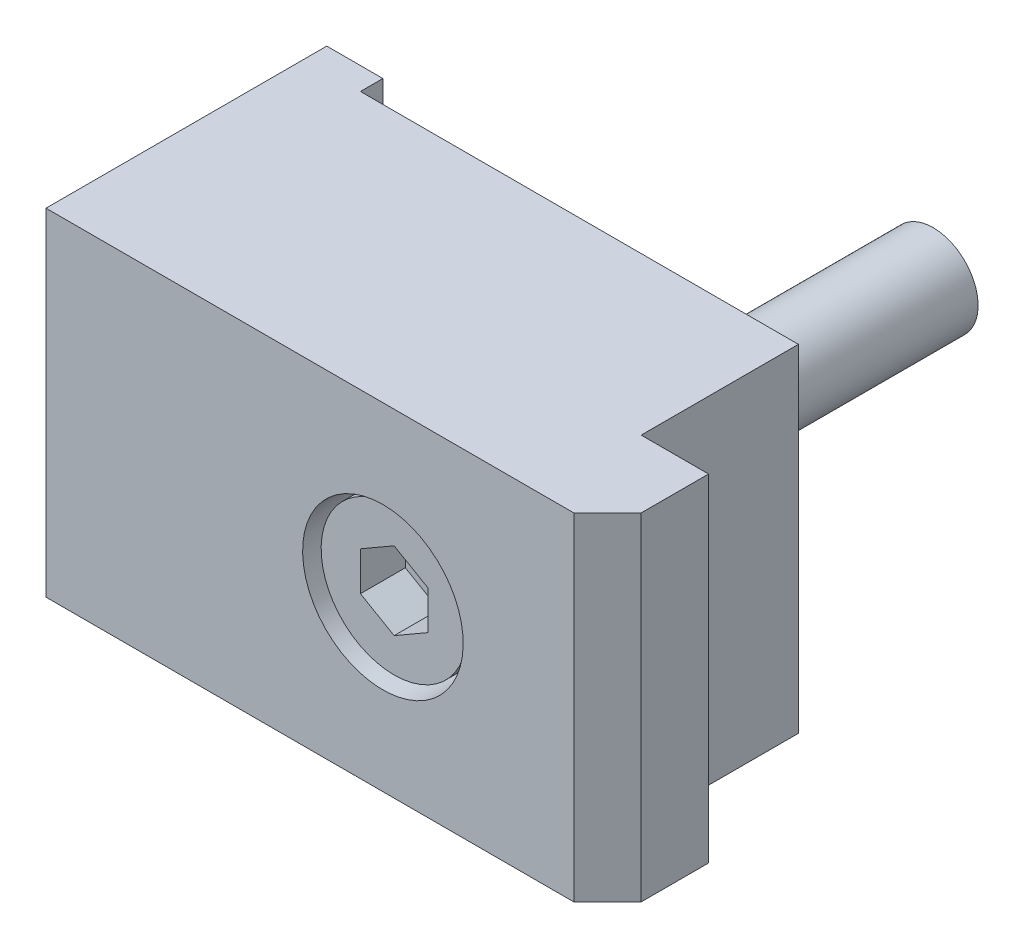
ISO-10303-21;
HEADER;
FILE_DESCRIPTION(('STEP AP214'),'2;1');
FILE_NAME('part.step','',(''),(''),'','','');
FILE_SCHEMA(('AUTOMOTIVE_DESIGN { 1 0 10303 214 1 1 1 1 }'));
ENDSEC;
DATA;
#1=APPLICATION_CONTEXT('core data for automotive mechanical design processes');
#2=APPLICATION_PROTOCOL_DEFINITION('international standard','automotive_design',2000,#1);
#3=PRODUCT_CONTEXT('',#1,'mechanical');
#4=PRODUCT('Part','Part','',(#3));
#5=PRODUCT_RELATED_PRODUCT_CATEGORY('part','',(#4));
#6=PRODUCT_DEFINITION_FORMATION('','',#4);
#7=PRODUCT_DEFINITION_CONTEXT('part definition',#1,'design');
#8=PRODUCT_DEFINITION('design','',#6,#7);
#9=PRODUCT_DEFINITION_SHAPE('','',#8);
#10=(LENGTH_UNIT() NAMED_UNIT(*) SI_UNIT(.MILLI.,.METRE.));
#11=(NAMED_UNIT(*) PLANE_ANGLE_UNIT() SI_UNIT($,.RADIAN.));
#12=(NAMED_UNIT(*) SI_UNIT($,.STERADIAN.) SOLID_ANGLE_UNIT());
#13=UNCERTAINTY_MEASURE_WITH_UNIT(LENGTH_MEASURE(1.E-05),#10,'distance_accuracy_value','');
#14=(GEOMETRIC_REPRESENTATION_CONTEXT(3) GLOBAL_UNCERTAINTY_ASSIGNED_CONTEXT((#13)) GLOBAL_UNIT_ASSIGNED_CONTEXT((#10,
#11,#12)) REPRESENTATION_CONTEXT('',''));
#15=CARTESIAN_POINT('',(0.,0.,0.));
#16=DIRECTION('',(0.,0.,1.));
#17=DIRECTION('',(1.,0.,0.));
#18=AXIS2_PLACEMENT_3D('',#15,#16,#17);
#19=CARTESIAN_POINT('',(-3.,-1.73205080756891,20.));
#20=DIRECTION('',(0.,0.,-1.));
#21=DIRECTION('',(0.,1.,0.));
#22=AXIS2_PLACEMENT_3D('',#19,#20,#21);
#23=PLANE('',#22);
#24=DIRECTION('',(0.866025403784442,-0.5,0.));
#25=VECTOR('',#24,1.);
#26=CARTESIAN_POINT('',(-3.,-1.73205080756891,20.));
#27=LINE('',#26,#25);
#28=CARTESIAN_POINT('',(-3.,-1.73205080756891,20.));
#29=VERTEX_POINT('',#28);
#30=CARTESIAN_POINT('',(0.,-3.46410161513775,20.));
#31=VERTEX_POINT('',#30);
#32=EDGE_CURVE('E259',#29,#31,#27,.T.);
#33=ORIENTED_EDGE('',*,*,#32,.T.);
#34=DIRECTION('',(0.866025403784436,0.5,0.));
#35=VECTOR('',#34,1.);
#36=CARTESIAN_POINT('',(0.,-3.46410161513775,20.));
#37=LINE('',#36,#35);
#38=CARTESIAN_POINT('',(3.,-1.73205080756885,20.));
#39=VERTEX_POINT('',#38);
#40=EDGE_CURVE('E261',#31,#39,#37,.T.);
#41=ORIENTED_EDGE('',*,*,#40,.T.);
#42=DIRECTION('',(0.,1.,0.));
#43=VECTOR('',#42,1.);
#44=CARTESIAN_POINT('',(3.,-1.73205080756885,20.));
#45=LINE('',#44,#43);
#46=CARTESIAN_POINT('',(3.,1.73205080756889,20.));
#47=VERTEX_POINT('',#46);
#48=EDGE_CURVE('E264',#39,#47,#45,.T.);
#49=ORIENTED_EDGE('',*,*,#48,.T.);
#50=DIRECTION('',(-0.866025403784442,0.5,0.));
#51=VECTOR('',#50,1.);
#52=CARTESIAN_POINT('',(3.,1.73205080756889,20.));
#53=LINE('',#52,#51);
#54=CARTESIAN_POINT('',(0.,3.46410161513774,20.));
#55=VERTEX_POINT('',#54);
#56=EDGE_CURVE('E154',#47,#55,#53,.T.);
#57=ORIENTED_EDGE('',*,*,#56,.T.);
#58=DIRECTION('',(-0.866025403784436,-0.5,0.));
#59=VECTOR('',#58,1.);
#60=CARTESIAN_POINT('',(0.,3.46410161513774,20.));
#61=LINE('',#60,#59);
#62=CARTESIAN_POINT('',(-3.,1.73205080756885,20.));
#63=VERTEX_POINT('',#62);
#64=EDGE_CURVE('E137',#55,#63,#61,.T.);
#65=ORIENTED_EDGE('',*,*,#64,.T.);
#66=DIRECTION('',(0.,-1.,0.));
#67=VECTOR('',#66,1.);
#68=CARTESIAN_POINT('',(-3.,1.73205080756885,20.));
#69=LINE('',#68,#67);
#70=EDGE_CURVE('E151',#63,#29,#69,.T.);
#71=ORIENTED_EDGE('',*,*,#70,.T.);
#72=EDGE_LOOP('',(#33,#41,#49,#57,#65,#71));
#73=FACE_BOUND('',#72,.T.);
#74=ADVANCED_FACE('F14',(#73),#23,.F.);
#75=CARTESIAN_POINT('',(0.,-3.46410161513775,20.));
#76=DIRECTION('',(0.5,-0.866025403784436,0.));
#77=DIRECTION('',(0.866025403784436,0.5,0.));
#78=AXIS2_PLACEMENT_3D('',#75,#76,#77);
#79=PLANE('',#78);
#80=DIRECTION('',(0.866025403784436,0.5,0.));
#81=VECTOR('',#80,1.);
#82=CARTESIAN_POINT('',(0.,-3.46410161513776,24.));
#83=LINE('',#82,#81);
#84=CARTESIAN_POINT('',(0.,-3.46410161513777,24.));
#85=VERTEX_POINT('',#84);
#86=CARTESIAN_POINT('',(3.,-1.73205080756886,24.));
#87=VERTEX_POINT('',#86);
#88=EDGE_CURVE('E246',#85,#87,#83,.T.);
#89=ORIENTED_EDGE('',*,*,#88,.T.);
#90=DIRECTION('',(0.,0.,1.));
#91=VECTOR('',#90,1.);
#92=CARTESIAN_POINT('',(3.,-1.73205080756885,20.));
#93=LINE('',#92,#91);
#94=EDGE_CURVE('E108',#39,#87,#93,.T.);
#95=ORIENTED_EDGE('',*,*,#94,.F.);
#96=ORIENTED_EDGE('',*,*,#40,.F.);
#97=DIRECTION('',(0.,0.,1.));
#98=VECTOR('',#97,1.);
#99=CARTESIAN_POINT('',(0.,-3.46410161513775,20.));
#100=LINE('',#99,#98);
#101=EDGE_CURVE('E158',#31,#85,#100,.T.);
#102=ORIENTED_EDGE('',*,*,#101,.T.);
#103=EDGE_LOOP('',(#89,#95,#96,#102));
#104=FACE_BOUND('',#103,.T.);
#105=ADVANCED_FACE('F276',(#104),#79,.F.);
#106=CARTESIAN_POINT('',(3.,-1.73205080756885,20.));
#107=DIRECTION('',(1.,0.,0.));
#108=DIRECTION('',(0.,1.,0.));
#109=AXIS2_PLACEMENT_3D('',#106,#107,#108);
#110=PLANE('',#109);
#111=DIRECTION('',(0.,1.,0.));
#112=VECTOR('',#111,1.);
#113=CARTESIAN_POINT('',(3.,-1.73205080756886,24.));
#114=LINE('',#113,#112);
#115=CARTESIAN_POINT('',(3.,1.73205080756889,24.));
#116=VERTEX_POINT('',#115);
#117=EDGE_CURVE('E248',#87,#116,#114,.T.);
#118=ORIENTED_EDGE('',*,*,#117,.T.);
#119=DIRECTION('',(0.,0.,1.));
#120=VECTOR('',#119,1.);
#121=CARTESIAN_POINT('',(3.,1.73205080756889,20.));
#122=LINE('',#121,#120);
#123=EDGE_CURVE('E166',#47,#116,#122,.T.);
#124=ORIENTED_EDGE('',*,*,#123,.F.);
#125=ORIENTED_EDGE('',*,*,#48,.F.);
#126=ORIENTED_EDGE('',*,*,#94,.T.);
#127=EDGE_LOOP('',(#118,#124,#125,#126));
#128=FACE_BOUND('',#127,.T.);
#129=ADVANCED_FACE('F266',(#128),#110,.F.);
#130=CARTESIAN_POINT('',(3.,1.73205080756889,20.));
#131=DIRECTION('',(0.5,0.866025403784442,0.));
#132=DIRECTION('',(-0.866025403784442,0.5,0.));
#133=AXIS2_PLACEMENT_3D('',#130,#131,#132);
#134=PLANE('',#133);
#135=DIRECTION('',(-0.866025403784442,0.5,0.));
#136=VECTOR('',#135,1.);
#137=CARTESIAN_POINT('',(3.,1.73205080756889,24.));
#138=LINE('',#137,#136);
#139=CARTESIAN_POINT('',(0.,3.46410161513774,24.));
#140=VERTEX_POINT('',#139);
#141=EDGE_CURVE('E253',#116,#140,#138,.T.);
#142=ORIENTED_EDGE('',*,*,#141,.T.);
#143=DIRECTION('',(0.,0.,1.));
#144=VECTOR('',#143,1.);
#145=CARTESIAN_POINT('',(0.,3.46410161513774,20.));
#146=LINE('',#145,#144);
#147=EDGE_CURVE('E146',#55,#140,#146,.T.);
#148=ORIENTED_EDGE('',*,*,#147,.F.);
#149=ORIENTED_EDGE('',*,*,#56,.F.);
#150=ORIENTED_EDGE('',*,*,#123,.T.);
#151=EDGE_LOOP('',(#142,#148,#149,#150));
#152=FACE_BOUND('',#151,.T.);
#153=ADVANCED_FACE('F270',(#152),#134,.F.);
#154=CARTESIAN_POINT('',(0.,3.46410161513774,20.));
#155=DIRECTION('',(-0.5,0.866025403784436,0.));
#156=DIRECTION('',(-0.866025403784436,-0.5,0.));
#157=AXIS2_PLACEMENT_3D('',#154,#155,#156);
#158=PLANE('',#157);
#159=DIRECTION('',(-0.866025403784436,-0.5,0.));
#160=VECTOR('',#159,1.);
#161=CARTESIAN_POINT('',(0.,3.46410161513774,24.));
#162=LINE('',#161,#160);
#163=CARTESIAN_POINT('',(-3.,1.73205080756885,24.));
#164=VERTEX_POINT('',#163);
#165=EDGE_CURVE('E140',#140,#164,#162,.T.);
#166=ORIENTED_EDGE('',*,*,#165,.T.);
#167=DIRECTION('',(0.,0.,1.));
#168=VECTOR('',#167,1.);
#169=CARTESIAN_POINT('',(-3.,1.73205080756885,20.));
#170=LINE('',#169,#168);
#171=EDGE_CURVE('E134',#63,#164,#170,.T.);
#172=ORIENTED_EDGE('',*,*,#171,.F.);
#173=ORIENTED_EDGE('',*,*,#64,.F.);
#174=ORIENTED_EDGE('',*,*,#147,.T.);
#175=EDGE_LOOP('',(#166,#172,#173,#174));
#176=FACE_BOUND('',#175,.T.);
#177=ADVANCED_FACE('F136',(#176),#158,.F.);
#178=CARTESIAN_POINT('',(-3.,1.73205080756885,20.));
#179=DIRECTION('',(-1.,0.,0.));
#180=DIRECTION('',(0.,-1.,0.));
#181=AXIS2_PLACEMENT_3D('',#178,#179,#180);
#182=PLANE('',#181);
#183=DIRECTION('',(0.,-1.,0.));
#184=VECTOR('',#183,1.);
#185=CARTESIAN_POINT('',(-3.,1.73205080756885,24.));
#186=LINE('',#185,#184);
#187=CARTESIAN_POINT('',(-3.,-1.73205080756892,24.));
#188=VERTEX_POINT('',#187);
#189=EDGE_CURVE('E257',#164,#188,#186,.T.);
#190=ORIENTED_EDGE('',*,*,#189,.T.);
#191=DIRECTION('',(0.,0.,1.));
#192=VECTOR('',#191,1.);
#193=CARTESIAN_POINT('',(-3.,-1.73205080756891,20.));
#194=LINE('',#193,#192);
#195=EDGE_CURVE('E145',#29,#188,#194,.T.);
#196=ORIENTED_EDGE('',*,*,#195,.F.);
#197=ORIENTED_EDGE('',*,*,#70,.F.);
#198=ORIENTED_EDGE('',*,*,#171,.T.);
#199=EDGE_LOOP('',(#190,#196,#197,#198));
#200=FACE_BOUND('',#199,.T.);
#201=ADVANCED_FACE('F156',(#200),#182,.F.);
#202=CARTESIAN_POINT('',(-3.,-1.73205080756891,20.));
#203=DIRECTION('',(-0.5,-0.866025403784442,0.));
#204=DIRECTION('',(0.866025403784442,-0.5,0.));
#205=AXIS2_PLACEMENT_3D('',#202,#203,#204);
#206=PLANE('',#205);
#207=DIRECTION('',(0.866025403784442,-0.5,0.));
#208=VECTOR('',#207,1.);
#209=CARTESIAN_POINT('',(-3.,-1.73205080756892,24.));
#210=LINE('',#209,#208);
#211=EDGE_CURVE('E33',#188,#85,#210,.T.);
#212=ORIENTED_EDGE('',*,*,#211,.T.);
#213=ORIENTED_EDGE('',*,*,#101,.F.);
#214=ORIENTED_EDGE('',*,*,#32,.F.);
#215=ORIENTED_EDGE('',*,*,#195,.T.);
#216=EDGE_LOOP('',(#212,#213,#214,#215));
#217=FACE_BOUND('',#216,.T.);
#218=ADVANCED_FACE('F277',(#217),#206,.F.);
#219=CARTESIAN_POINT('',(0.,0.,24.));
#220=DIRECTION('',(0.,0.,1.));
#221=DIRECTION('',(0.,-1.,0.));
#222=AXIS2_PLACEMENT_3D('',#219,#220,#221);
#223=PLANE('',#222);
#224=ORIENTED_EDGE('',*,*,#211,.F.);
#225=ORIENTED_EDGE('',*,*,#189,.F.);
#226=ORIENTED_EDGE('',*,*,#165,.F.);
#227=ORIENTED_EDGE('',*,*,#141,.F.);
#228=ORIENTED_EDGE('',*,*,#117,.F.);
#229=ORIENTED_EDGE('',*,*,#88,.F.);
#230=EDGE_LOOP('',(#224,#225,#226,#227,#228,#229));
#231=FACE_BOUND('',#230,.T.);
#232=CARTESIAN_POINT('',(0.,0.,24.));
#233=DIRECTION('',(0.,0.,1.));
#234=DIRECTION('',(0.,-1.,0.));
#235=AXIS2_PLACEMENT_3D('',#232,#233,#234);
#236=CIRCLE('',#235,6.5);
#237=CARTESIAN_POINT('',(0.,-6.5,24.));
#238=VERTEX_POINT('',#237);
#239=EDGE_CURVE('E171',#238,#238,#236,.T.);
#240=ORIENTED_EDGE('',*,*,#239,.T.);
#241=EDGE_LOOP('',(#240));
#242=FACE_BOUND('',#241,.T.);
#243=ADVANCED_FACE('F272',(#231,#242),#223,.T.);
#244=CARTESIAN_POINT('',(0.,0.,24.));
#245=DIRECTION('',(0.,0.,-1.));
#246=DIRECTION('',(0.,1.,0.));
#247=AXIS2_PLACEMENT_3D('',#244,#245,#246);
#248=CYLINDRICAL_SURFACE('',#247,6.5);
#249=ORIENTED_EDGE('',*,*,#239,.F.);
#250=EDGE_LOOP('',(#249));
#251=FACE_BOUND('',#250,.T.);
#252=CARTESIAN_POINT('',(0.,0.,16.));
#253=DIRECTION('',(0.,0.,1.));
#254=DIRECTION('',(0.,-1.,0.));
#255=AXIS2_PLACEMENT_3D('',#252,#253,#254);
#256=CIRCLE('',#255,6.5);
#257=CARTESIAN_POINT('',(0.,-6.5,16.));
#258=VERTEX_POINT('',#257);
#259=EDGE_CURVE('E163',#258,#258,#256,.T.);
#260=ORIENTED_EDGE('',*,*,#259,.T.);
#261=EDGE_LOOP('',(#260));
#262=FACE_BOUND('',#261,.T.);
#263=ADVANCED_FACE('F286',(#251,#262),#248,.T.);
#264=CARTESIAN_POINT('',(0.,0.,16.));
#265=DIRECTION('',(0.,0.,1.));
#266=DIRECTION('',(0.,-1.,0.));
#267=AXIS2_PLACEMENT_3D('',#264,#265,#266);
#268=PLANE('',#267);
#269=CARTESIAN_POINT('',(0.,0.,16.));
#270=DIRECTION('',(0.,0.,1.));
#271=DIRECTION('',(0.,-1.,0.));
#272=AXIS2_PLACEMENT_3D('',#269,#270,#271);
#273=CIRCLE('',#272,4.);
#274=CARTESIAN_POINT('',(0.,-4.,16.));
#275=VERTEX_POINT('',#274);
#276=EDGE_CURVE('E24',#275,#275,#273,.T.);
#277=ORIENTED_EDGE('',*,*,#276,.T.);
#278=EDGE_LOOP('',(#277));
#279=FACE_BOUND('',#278,.T.);
#280=CARTESIAN_POINT('',(0.,0.,16.));
#281=DIRECTION('',(0.,0.,1.));
#282=DIRECTION('',(0.,-1.,0.));
#283=AXIS2_PLACEMENT_3D('',#280,#281,#282);
#284=CIRCLE('',#283,4.5);
#285=CARTESIAN_POINT('',(0.,-4.49999999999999,16.));
#286=VERTEX_POINT('',#285);
#287=EDGE_CURVE('E9',#286,#286,#284,.T.);
#288=ORIENTED_EDGE('',*,*,#287,.F.);
#289=EDGE_LOOP('',(#288));
#290=FACE_BOUND('',#289,.T.);
#291=ADVANCED_FACE('F360',(#279,#290),#268,.F.);
#292=CARTESIAN_POINT('',(0.,0.,16.));
#293=DIRECTION('',(0.,0.,-1.));
#294=DIRECTION('',(0.,1.,0.));
#295=AXIS2_PLACEMENT_3D('',#292,#293,#294);
#296=CYLINDRICAL_SURFACE('',#295,4.);
#297=ORIENTED_EDGE('',*,*,#276,.F.);
#298=EDGE_LOOP('',(#297));
#299=FACE_BOUND('',#298,.T.);
#300=CARTESIAN_POINT('',(0.,0.,-24.));
#301=DIRECTION('',(0.,0.,-1.));
#302=DIRECTION('',(-1.,0.,0.));
#303=AXIS2_PLACEMENT_3D('',#300,#301,#302);
#304=CIRCLE('',#303,4.);
#305=CARTESIAN_POINT('',(-4.,0.,-24.));
#306=VERTEX_POINT('',#305);
#307=EDGE_CURVE('E180',#306,#306,#304,.T.);
#308=ORIENTED_EDGE('',*,*,#307,.F.);
#309=EDGE_LOOP('',(#308));
#310=FACE_BOUND('',#309,.T.);
#311=ADVANCED_FACE('F368',(#299,#310),#296,.T.);
#312=CARTESIAN_POINT('',(14.,15.,16.));
#313=DIRECTION('',(0.,0.,1.));
#314=DIRECTION('',(1.,0.,0.));
#315=AXIS2_PLACEMENT_3D('',#312,#313,#314);
#316=PLANE('',#315);
#317=DIRECTION('',(-1.,0.,0.));
#318=VECTOR('',#317,1.);
#319=CARTESIAN_POINT('',(14.,-15.,16.));
#320=LINE('',#319,#318);
#321=CARTESIAN_POINT('',(20.,-15.,16.));
#322=VERTEX_POINT('',#321);
#323=CARTESIAN_POINT('',(14.,-15.,16.));
#324=VERTEX_POINT('',#323);
#325=EDGE_CURVE('E198',#322,#324,#320,.T.);
#326=ORIENTED_EDGE('',*,*,#325,.T.);
#327=DIRECTION('',(0.,-1.,0.));
#328=VECTOR('',#327,1.);
#329=CARTESIAN_POINT('',(14.,15.,16.));
#330=LINE('',#329,#328);
#331=CARTESIAN_POINT('',(14.,15.,16.));
#332=VERTEX_POINT('',#331);
#333=EDGE_CURVE('E217',#332,#324,#330,.T.);
#334=ORIENTED_EDGE('',*,*,#333,.F.);
#335=DIRECTION('',(-1.,0.,0.));
#336=VECTOR('',#335,1.);
#337=CARTESIAN_POINT('',(14.,15.,16.));
#338=LINE('',#337,#336);
#339=CARTESIAN_POINT('',(20.,15.,16.));
#340=VERTEX_POINT('',#339);
#341=EDGE_CURVE('E215',#340,#332,#338,.T.);
#342=ORIENTED_EDGE('',*,*,#341,.F.);
#343=DIRECTION('',(0.,-1.,0.));
#344=VECTOR('',#343,1.);
#345=CARTESIAN_POINT('',(20.,15.,16.));
#346=LINE('',#345,#344);
#347=EDGE_CURVE('E220',#340,#322,#346,.T.);
#348=ORIENTED_EDGE('',*,*,#347,.T.);
#349=EDGE_LOOP('',(#326,#334,#342,#348));
#350=FACE_BOUND('',#349,.T.);
#351=ADVANCED_FACE('F377',(#350),#316,.F.);
#352=CARTESIAN_POINT('',(-25.,15.,0.));
#353=DIRECTION('',(0.,0.,1.));
#354=DIRECTION('',(0.,1.,0.));
#355=AXIS2_PLACEMENT_3D('',#352,#353,#354);
#356=PLANE('',#355);
#357=DIRECTION('',(-1.,0.,0.));
#358=VECTOR('',#357,1.);
#359=CARTESIAN_POINT('',(-25.,-15.,0.));
#360=LINE('',#359,#358);
#361=CARTESIAN_POINT('',(-25.,-15.,0.));
#362=VERTEX_POINT('',#361);
#363=CARTESIAN_POINT('',(-30.,-15.,0.));
#364=VERTEX_POINT('',#363);
#365=EDGE_CURVE('E190',#362,#364,#360,.T.);
#366=ORIENTED_EDGE('',*,*,#365,.T.);
#367=DIRECTION('',(0.,-1.,0.));
#368=VECTOR('',#367,1.);
#369=CARTESIAN_POINT('',(-30.,15.,0.));
#370=LINE('',#369,#368);
#371=CARTESIAN_POINT('',(-30.,15.,0.));
#372=VERTEX_POINT('',#371);
#373=EDGE_CURVE('E226',#372,#364,#370,.T.);
#374=ORIENTED_EDGE('',*,*,#373,.F.);
#375=DIRECTION('',(-1.,0.,0.));
#376=VECTOR('',#375,1.);
#377=CARTESIAN_POINT('',(-25.,15.,0.));
#378=LINE('',#377,#376);
#379=CARTESIAN_POINT('',(-25.,15.,0.));
#380=VERTEX_POINT('',#379);
#381=EDGE_CURVE('E207',#380,#372,#378,.T.);
#382=ORIENTED_EDGE('',*,*,#381,.F.);
#383=DIRECTION('',(0.,-1.,0.));
#384=VECTOR('',#383,1.);
#385=CARTESIAN_POINT('',(-25.,15.,0.));
#386=LINE('',#385,#384);
#387=EDGE_CURVE('E229',#380,#362,#386,.T.);
#388=ORIENTED_EDGE('',*,*,#387,.T.);
#389=EDGE_LOOP('',(#366,#374,#382,#388));
#390=FACE_BOUND('',#389,.T.);
#391=ADVANCED_FACE('F386',(#390),#356,.F.);
#392=CARTESIAN_POINT('',(20.,15.,16.));
#393=DIRECTION('',(-1.,0.,0.));
#394=DIRECTION('',(0.,-1.,0.));
#395=AXIS2_PLACEMENT_3D('',#392,#393,#394);
#396=PLANE('',#395);
#397=DIRECTION('',(0.,0.,-1.));
#398=VECTOR('',#397,1.);
#399=CARTESIAN_POINT('',(20.,15.,16.));
#400=LINE('',#399,#398);
#401=CARTESIAN_POINT('',(20.,15.,22.));
#402=VERTEX_POINT('',#401);
#403=EDGE_CURVE('E213',#402,#340,#400,.T.);
#404=ORIENTED_EDGE('',*,*,#403,.F.);
#405=DIRECTION('',(0.,-1.,0.));
#406=VECTOR('',#405,1.);
#407=CARTESIAN_POINT('',(20.,15.,22.));
#408=LINE('',#407,#406);
#409=CARTESIAN_POINT('',(20.,-15.,22.));
#410=VERTEX_POINT('',#409);
#411=EDGE_CURVE('E238',#402,#410,#408,.T.);
#412=ORIENTED_EDGE('',*,*,#411,.T.);
#413=DIRECTION('',(0.,0.,-1.));
#414=VECTOR('',#413,1.);
#415=CARTESIAN_POINT('',(20.,-15.,16.));
#416=LINE('',#415,#414);
#417=EDGE_CURVE('E196',#410,#322,#416,.T.);
#418=ORIENTED_EDGE('',*,*,#417,.T.);
#419=ORIENTED_EDGE('',*,*,#347,.F.);
#420=EDGE_LOOP('',(#404,#412,#418,#419));
#421=FACE_BOUND('',#420,.T.);
#422=ADVANCED_FACE('F390',(#421),#396,.F.);
#423=CARTESIAN_POINT('',(-30.,15.,25.));
#424=DIRECTION('',(1.,0.,0.));
#425=DIRECTION('',(0.,0.,-1.));
#426=AXIS2_PLACEMENT_3D('',#423,#424,#425);
#427=PLANE('',#426);
#428=DIRECTION('',(0.,0.,1.));
#429=VECTOR('',#428,1.);
#430=CARTESIAN_POINT('',(-30.,-15.,25.));
#431=LINE('',#430,#429);
#432=CARTESIAN_POINT('',(-30.,-15.,25.));
#433=VERTEX_POINT('',#432);
#434=EDGE_CURVE('E192',#364,#433,#431,.T.);
#435=ORIENTED_EDGE('',*,*,#434,.T.);
#436=DIRECTION('',(0.,-1.,0.));
#437=VECTOR('',#436,1.);
#438=CARTESIAN_POINT('',(-30.,15.,25.));
#439=LINE('',#438,#437);
#440=CARTESIAN_POINT('',(-30.,15.,25.));
#441=VERTEX_POINT('',#440);
#442=EDGE_CURVE('E223',#441,#433,#439,.T.);
#443=ORIENTED_EDGE('',*,*,#442,.F.);
#444=DIRECTION('',(0.,0.,1.));
#445=VECTOR('',#444,1.);
#446=CARTESIAN_POINT('',(-30.,15.,25.));
#447=LINE('',#446,#445);
#448=EDGE_CURVE('E209',#372,#441,#447,.T.);
#449=ORIENTED_EDGE('',*,*,#448,.F.);
#450=ORIENTED_EDGE('',*,*,#373,.T.);
#451=EDGE_LOOP('',(#435,#443,#449,#450));
#452=FACE_BOUND('',#451,.T.);
#453=ADVANCED_FACE('F399',(#452),#427,.F.);
#454=CARTESIAN_POINT('',(20.,15.,22.));
#455=DIRECTION('',(-0.707106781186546,0.,-0.707106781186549));
#456=DIRECTION('',(-0.707106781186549,0.,0.707106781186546));
#457=AXIS2_PLACEMENT_3D('',#454,#455,#456);
#458=PLANE('',#457);
#459=DIRECTION('',(-0.707106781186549,0.,0.707106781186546));
#460=VECTOR('',#459,1.);
#461=CARTESIAN_POINT('',(20.,15.,22.));
#462=LINE('',#461,#460);
#463=CARTESIAN_POINT('',(17.,15.,25.));
#464=VERTEX_POINT('',#463);
#465=EDGE_CURVE('E242',#464,#402,#462,.F.);
#466=ORIENTED_EDGE('',*,*,#465,.F.);
#467=DIRECTION('',(0.,1.,0.));
#468=VECTOR('',#467,1.);
#469=CARTESIAN_POINT('',(17.,15.,25.));
#470=LINE('',#469,#468);
#471=CARTESIAN_POINT('',(17.,-15.,25.));
#472=VERTEX_POINT('',#471);
#473=EDGE_CURVE('E99',#472,#464,#470,.T.);
#474=ORIENTED_EDGE('',*,*,#473,.F.);
#475=DIRECTION('',(0.707106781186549,0.,-0.707106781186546));
#476=VECTOR('',#475,1.);
#477=CARTESIAN_POINT('',(15.5,-15.,26.5));
#478=LINE('',#477,#476);
#479=EDGE_CURVE('E92',#410,#472,#478,.F.);
#480=ORIENTED_EDGE('',*,*,#479,.F.);
#481=ORIENTED_EDGE('',*,*,#411,.F.);
#482=EDGE_LOOP('',(#466,#474,#480,#481));
#483=FACE_BOUND('',#482,.T.);
#484=ADVANCED_FACE('F416',(#483),#458,.F.);
#485=CARTESIAN_POINT('',(14.,15.,2.));
#486=DIRECTION('',(-1.,0.,0.));
#487=DIRECTION('',(0.,-1.,0.));
#488=AXIS2_PLACEMENT_3D('',#485,#486,#487);
#489=PLANE('',#488);
#490=DIRECTION('',(0.,0.,-1.));
#491=VECTOR('',#490,1.);
#492=CARTESIAN_POINT('',(14.,-15.,2.));
#493=LINE('',#492,#491);
#494=CARTESIAN_POINT('',(14.,-15.,2.));
#495=VERTEX_POINT('',#494);
#496=EDGE_CURVE('E183',#324,#495,#493,.T.);
#497=ORIENTED_EDGE('',*,*,#496,.T.);
#498=DIRECTION('',(0.,-1.,0.));
#499=VECTOR('',#498,1.);
#500=CARTESIAN_POINT('',(14.,15.,2.));
#501=LINE('',#500,#499);
#502=CARTESIAN_POINT('',(14.,15.,2.));
#503=VERTEX_POINT('',#502);
#504=EDGE_CURVE('E235',#503,#495,#501,.T.);
#505=ORIENTED_EDGE('',*,*,#504,.F.);
#506=DIRECTION('',(0.,0.,-1.));
#507=VECTOR('',#506,1.);
#508=CARTESIAN_POINT('',(14.,15.,2.));
#509=LINE('',#508,#507);
#510=EDGE_CURVE('E200',#332,#503,#509,.T.);
#511=ORIENTED_EDGE('',*,*,#510,.F.);
#512=ORIENTED_EDGE('',*,*,#333,.T.);
#513=EDGE_LOOP('',(#497,#505,#511,#512));
#514=FACE_BOUND('',#513,.T.);
#515=ADVANCED_FACE('F16',(#514),#489,.F.);
#516=CARTESIAN_POINT('',(14.,15.,25.));
#517=DIRECTION('',(0.,-1.,0.));
#518=DIRECTION('',(1.,0.,0.));
#519=AXIS2_PLACEMENT_3D('',#516,#517,#518);
#520=PLANE('',#519);
#521=DIRECTION('',(1.,0.,0.));
#522=VECTOR('',#521,1.);
#523=CARTESIAN_POINT('',(20.,15.,25.));
#524=LINE('',#523,#522);
#525=EDGE_CURVE('E211',#441,#464,#524,.T.);
#526=ORIENTED_EDGE('',*,*,#525,.T.);
#527=ORIENTED_EDGE('',*,*,#465,.T.);
#528=ORIENTED_EDGE('',*,*,#403,.T.);
#529=ORIENTED_EDGE('',*,*,#341,.T.);
#530=ORIENTED_EDGE('',*,*,#510,.T.);
#531=DIRECTION('',(-1.,0.,0.));
#532=VECTOR('',#531,1.);
#533=CARTESIAN_POINT('',(14.,15.,2.));
#534=LINE('',#533,#532);
#535=CARTESIAN_POINT('',(-25.,15.,2.));
#536=VERTEX_POINT('',#535);
#537=EDGE_CURVE('E203',#503,#536,#534,.T.);
#538=ORIENTED_EDGE('',*,*,#537,.T.);
#539=DIRECTION('',(0.,0.,-1.));
#540=VECTOR('',#539,1.);
#541=CARTESIAN_POINT('',(-25.,15.,2.));
#542=LINE('',#541,#540);
#543=EDGE_CURVE('E205',#536,#380,#542,.T.);
#544=ORIENTED_EDGE('',*,*,#543,.T.);
#545=ORIENTED_EDGE('',*,*,#381,.T.);
#546=ORIENTED_EDGE('',*,*,#448,.T.);
#547=EDGE_LOOP('',(#526,#527,#528,#529,#530,#538,#544,#545,#546));
#548=FACE_BOUND('',#547,.T.);
#549=ADVANCED_FACE('F389',(#548),#520,.F.);
#550=CARTESIAN_POINT('',(-25.,15.,2.));
#551=DIRECTION('',(-1.,0.,0.));
#552=DIRECTION('',(0.,-1.,0.));
#553=AXIS2_PLACEMENT_3D('',#550,#551,#552);
#554=PLANE('',#553);
#555=DIRECTION('',(0.,0.,-1.));
#556=VECTOR('',#555,1.);
#557=CARTESIAN_POINT('',(-25.,-15.,2.));
#558=LINE('',#557,#556);
#559=CARTESIAN_POINT('',(-25.,-15.,2.));
#560=VERTEX_POINT('',#559);
#561=EDGE_CURVE('E188',#560,#362,#558,.T.);
#562=ORIENTED_EDGE('',*,*,#561,.T.);
#563=ORIENTED_EDGE('',*,*,#387,.F.);
#564=ORIENTED_EDGE('',*,*,#543,.F.);
#565=DIRECTION('',(0.,-1.,0.));
#566=VECTOR('',#565,1.);
#567=CARTESIAN_POINT('',(-25.,15.,2.));
#568=LINE('',#567,#566);
#569=EDGE_CURVE('E232',#536,#560,#568,.T.);
#570=ORIENTED_EDGE('',*,*,#569,.T.);
#571=EDGE_LOOP('',(#562,#563,#564,#570));
#572=FACE_BOUND('',#571,.T.);
#573=ADVANCED_FACE('F400',(#572),#554,.F.);
#574=CARTESIAN_POINT('',(14.,-15.,25.));
#575=DIRECTION('',(0.,-1.,0.));
#576=DIRECTION('',(1.,0.,0.));
#577=AXIS2_PLACEMENT_3D('',#574,#575,#576);
#578=PLANE('',#577);
#579=ORIENTED_EDGE('',*,*,#417,.F.);
#580=ORIENTED_EDGE('',*,*,#479,.T.);
#581=DIRECTION('',(1.,0.,0.));
#582=VECTOR('',#581,1.);
#583=CARTESIAN_POINT('',(20.,-15.,25.));
#584=LINE('',#583,#582);
#585=EDGE_CURVE('E194',#433,#472,#584,.T.);
#586=ORIENTED_EDGE('',*,*,#585,.F.);
#587=ORIENTED_EDGE('',*,*,#434,.F.);
#588=ORIENTED_EDGE('',*,*,#365,.F.);
#589=ORIENTED_EDGE('',*,*,#561,.F.);
#590=DIRECTION('',(-1.,0.,0.));
#591=VECTOR('',#590,1.);
#592=CARTESIAN_POINT('',(14.,-15.,2.));
#593=LINE('',#592,#591);
#594=EDGE_CURVE('E186',#495,#560,#593,.T.);
#595=ORIENTED_EDGE('',*,*,#594,.F.);
#596=ORIENTED_EDGE('',*,*,#496,.F.);
#597=ORIENTED_EDGE('',*,*,#325,.F.);
#598=EDGE_LOOP('',(#579,#580,#586,#587,#588,#589,#595,#596,#597));
#599=FACE_BOUND('',#598,.T.);
#600=ADVANCED_FACE('F428',(#599),#578,.T.);
#601=CARTESIAN_POINT('',(14.,15.,2.));
#602=DIRECTION('',(0.,0.,1.));
#603=DIRECTION('',(0.,1.,0.));
#604=AXIS2_PLACEMENT_3D('',#601,#602,#603);
#605=PLANE('',#604);
#606=CARTESIAN_POINT('',(0.,0.,2.));
#607=DIRECTION('',(0.,0.,1.));
#608=DIRECTION('',(0.,1.,0.));
#609=AXIS2_PLACEMENT_3D('',#606,#607,#608);
#610=CIRCLE('',#609,4.5);
#611=CARTESIAN_POINT('',(0.,4.50000000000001,2.));
#612=VERTEX_POINT('',#611);
#613=EDGE_CURVE('E18',#612,#612,#610,.T.);
#614=ORIENTED_EDGE('',*,*,#613,.T.);
#615=EDGE_LOOP('',(#614));
#616=FACE_BOUND('',#615,.T.);
#617=ORIENTED_EDGE('',*,*,#594,.T.);
#618=ORIENTED_EDGE('',*,*,#569,.F.);
#619=ORIENTED_EDGE('',*,*,#537,.F.);
#620=ORIENTED_EDGE('',*,*,#504,.T.);
#621=EDGE_LOOP('',(#617,#618,#619,#620));
#622=FACE_BOUND('',#621,.T.);
#623=ADVANCED_FACE('F436',(#616,#622),#605,.F.);
#624=CARTESIAN_POINT('',(0.,0.,25.));
#625=DIRECTION('',(0.,0.,1.));
#626=DIRECTION('',(0.,1.,0.));
#627=AXIS2_PLACEMENT_3D('',#624,#625,#626);
#628=CYLINDRICAL_SURFACE('',#627,4.5);
#629=ORIENTED_EDGE('',*,*,#287,.T.);
#630=EDGE_LOOP('',(#629));
#631=FACE_BOUND('',#630,.T.);
#632=ORIENTED_EDGE('',*,*,#613,.F.);
#633=EDGE_LOOP('',(#632));
#634=FACE_BOUND('',#633,.T.);
#635=ADVANCED_FACE('F427',(#631,#634),#628,.F.);
#636=CARTESIAN_POINT('',(20.,15.,25.));
#637=DIRECTION('',(0.,0.,-1.));
#638=DIRECTION('',(0.,-1.,0.));
#639=AXIS2_PLACEMENT_3D('',#636,#637,#638);
#640=PLANE('',#639);
#641=CARTESIAN_POINT('',(0.,0.,25.));
#642=DIRECTION('',(0.,0.,1.));
#643=DIRECTION('',(0.,1.,0.));
#644=AXIS2_PLACEMENT_3D('',#641,#642,#643);
#645=CIRCLE('',#644,7.15);
#646=CARTESIAN_POINT('',(0.,7.15000000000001,25.));
#647=VERTEX_POINT('',#646);
#648=EDGE_CURVE('E179',#647,#647,#645,.T.);
#649=ORIENTED_EDGE('',*,*,#648,.F.);
#650=EDGE_LOOP('',(#649));
#651=FACE_BOUND('',#650,.T.);
#652=ORIENTED_EDGE('',*,*,#585,.T.);
#653=ORIENTED_EDGE('',*,*,#473,.T.);
#654=ORIENTED_EDGE('',*,*,#525,.F.);
#655=ORIENTED_EDGE('',*,*,#442,.T.);
#656=EDGE_LOOP('',(#652,#653,#654,#655));
#657=FACE_BOUND('',#656,.T.);
#658=ADVANCED_FACE('F409',(#651,#657),#640,.F.);
#659=CARTESIAN_POINT('',(0.,0.,25.));
#660=DIRECTION('',(0.,0.,1.));
#661=DIRECTION('',(0.,1.,0.));
#662=AXIS2_PLACEMENT_3D('',#659,#660,#661);
#663=CYLINDRICAL_SURFACE('',#662,7.15);
#664=CARTESIAN_POINT('',(0.,0.,16.));
#665=DIRECTION('',(0.,0.,1.));
#666=DIRECTION('',(0.,1.,0.));
#667=AXIS2_PLACEMENT_3D('',#664,#665,#666);
#668=CIRCLE('',#667,7.15);
#669=CARTESIAN_POINT('',(0.,7.15000000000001,16.));
#670=VERTEX_POINT('',#669);
#671=EDGE_CURVE('E176',#670,#670,#668,.T.);
#672=ORIENTED_EDGE('',*,*,#671,.F.);
#673=EDGE_LOOP('',(#672));
#674=FACE_BOUND('',#673,.T.);
#675=ORIENTED_EDGE('',*,*,#648,.T.);
#676=EDGE_LOOP('',(#675));
#677=FACE_BOUND('',#676,.T.);
#678=ADVANCED_FACE('F474',(#674,#677),#663,.F.);
#679=CARTESIAN_POINT('',(-4.5,0.,16.));
#680=DIRECTION('',(0.,0.,-1.));
#681=DIRECTION('',(0.,-1.,0.));
#682=AXIS2_PLACEMENT_3D('',#679,#680,#681);
#683=PLANE('',#682);
#684=ORIENTED_EDGE('',*,*,#259,.F.);
#685=EDGE_LOOP('',(#684));
#686=FACE_BOUND('',#685,.T.);
#687=ORIENTED_EDGE('',*,*,#671,.T.);
#688=EDGE_LOOP('',(#687));
#689=FACE_BOUND('',#688,.T.);
#690=ADVANCED_FACE('F370',(#686,#689),#683,.F.);
#691=CARTESIAN_POINT('',(0.,0.,-24.));
#692=DIRECTION('',(0.,0.,-1.));
#693=DIRECTION('',(-1.,0.,0.));
#694=AXIS2_PLACEMENT_3D('',#691,#692,#693);
#695=PLANE('',#694);
#696=ORIENTED_EDGE('',*,*,#307,.T.);
#697=EDGE_LOOP('',(#696));
#698=FACE_BOUND('',#697,.T.);
#699=ADVANCED_FACE('F298',(#698),#695,.T.);
#700=CLOSED_SHELL('',(#74,#105,#129,#153,#177,#201,#218,#243,#263,#291,#311,#351,#391,#422,#453,
#484,#515,#549,#573,#600,#623,#635,#658,#678,#690,#699));
#701=MANIFOLD_SOLID_BREP('B1',#700);
#702=ADVANCED_BREP_SHAPE_REPRESENTATION('',(#18,#701),#14);
#703=SHAPE_DEFINITION_REPRESENTATION(#9,#702);
ENDSEC;
END-ISO-10303-21;
